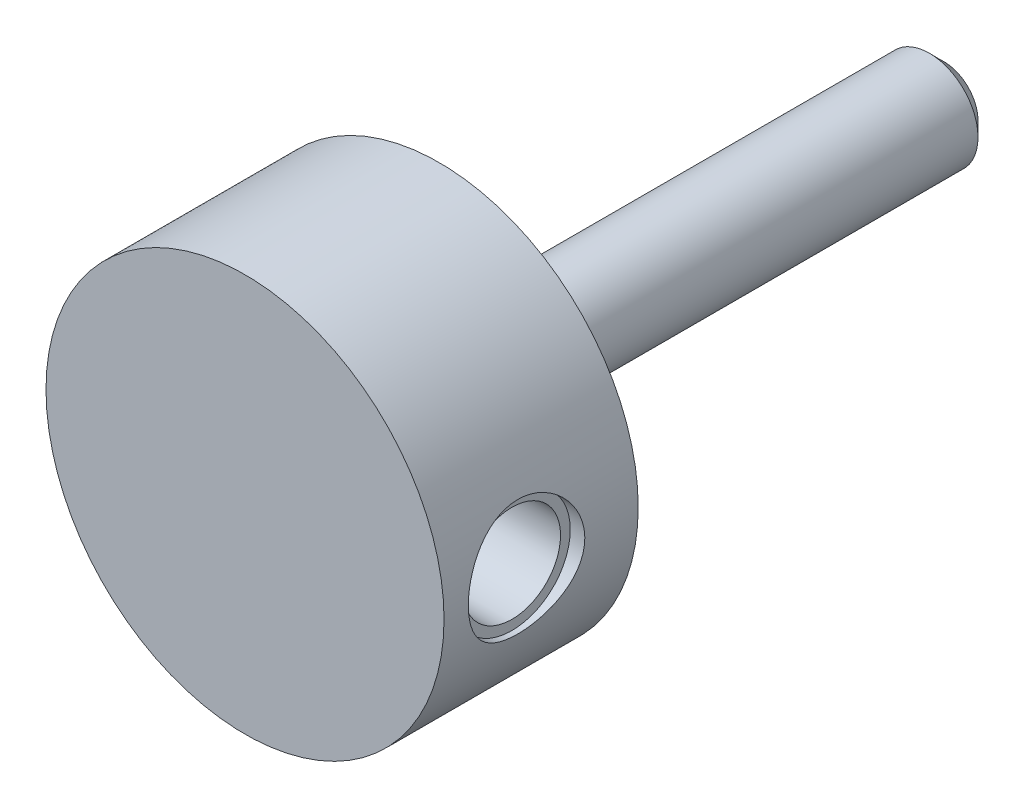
ISO-10303-21;
HEADER;
FILE_DESCRIPTION(('STEP AP214'),'2;1');
FILE_NAME('part.step','',(''),(''),'','','');
FILE_SCHEMA(('AUTOMOTIVE_DESIGN { 1 0 10303 214 1 1 1 1 }'));
ENDSEC;
DATA;
#1=APPLICATION_CONTEXT('core data for automotive mechanical design processes');
#2=APPLICATION_PROTOCOL_DEFINITION('international standard','automotive_design',2000,#1);
#3=PRODUCT_CONTEXT('',#1,'mechanical');
#4=PRODUCT('Part','Part','',(#3));
#5=PRODUCT_RELATED_PRODUCT_CATEGORY('part','',(#4));
#6=PRODUCT_DEFINITION_FORMATION('','',#4);
#7=PRODUCT_DEFINITION_CONTEXT('part definition',#1,'design');
#8=PRODUCT_DEFINITION('design','',#6,#7);
#9=PRODUCT_DEFINITION_SHAPE('','',#8);
#10=(LENGTH_UNIT() NAMED_UNIT(*) SI_UNIT(.MILLI.,.METRE.));
#11=(NAMED_UNIT(*) PLANE_ANGLE_UNIT() SI_UNIT($,.RADIAN.));
#12=(NAMED_UNIT(*) SI_UNIT($,.STERADIAN.) SOLID_ANGLE_UNIT());
#13=UNCERTAINTY_MEASURE_WITH_UNIT(LENGTH_MEASURE(1.E-05),#10,'distance_accuracy_value','');
#14=(GEOMETRIC_REPRESENTATION_CONTEXT(3) GLOBAL_UNCERTAINTY_ASSIGNED_CONTEXT((#13)) GLOBAL_UNIT_ASSIGNED_CONTEXT((#10,
#11,#12)) REPRESENTATION_CONTEXT('',''));
#15=CARTESIAN_POINT('',(0.,0.,0.));
#16=DIRECTION('',(0.,0.,1.));
#17=DIRECTION('',(1.,0.,0.));
#18=AXIS2_PLACEMENT_3D('',#15,#16,#17);
#19=CARTESIAN_POINT('',(0.,0.,0.));
#20=DIRECTION('',(0.,0.,1.));
#21=DIRECTION('',(1.,0.,0.));
#22=AXIS2_PLACEMENT_3D('',#19,#20,#21);
#23=PLANE('',#22);
#24=CARTESIAN_POINT('',(0.,0.,0.));
#25=DIRECTION('',(0.,0.,1.));
#26=DIRECTION('',(1.,0.,0.));
#27=AXIS2_PLACEMENT_3D('',#24,#25,#26);
#28=CIRCLE('',#27,9.5);
#29=CARTESIAN_POINT('',(9.5,0.,0.));
#30=VERTEX_POINT('',#29);
#31=EDGE_CURVE('E27',#30,#30,#28,.T.);
#32=ORIENTED_EDGE('',*,*,#31,.F.);
#33=EDGE_LOOP('',(#32));
#34=FACE_BOUND('',#33,.T.);
#35=CARTESIAN_POINT('',(0.,0.,0.));
#36=DIRECTION('',(0.,0.,1.));
#37=DIRECTION('',(1.,0.,0.));
#38=AXIS2_PLACEMENT_3D('',#35,#36,#37);
#39=CIRCLE('',#38,5.);
#40=CARTESIAN_POINT('',(5.,0.,0.));
#41=VERTEX_POINT('',#40);
#42=EDGE_CURVE('E23',#41,#41,#39,.F.);
#43=ORIENTED_EDGE('',*,*,#42,.F.);
#44=EDGE_LOOP('',(#43));
#45=FACE_BOUND('',#44,.T.);
#46=ADVANCED_FACE('F12',(#34,#45),#23,.F.);
#47=CARTESIAN_POINT('',(0.,0.,40.));
#48=DIRECTION('',(0.,0.,1.));
#49=DIRECTION('',(1.,0.,0.));
#50=AXIS2_PLACEMENT_3D('',#47,#48,#49);
#51=CYLINDRICAL_SURFACE('',#50,9.5);
#52=CARTESIAN_POINT('',(0.,0.,2.));
#53=DIRECTION('',(0.,0.,1.));
#54=DIRECTION('',(1.,0.,0.));
#55=AXIS2_PLACEMENT_3D('',#52,#53,#54);
#56=CIRCLE('',#55,9.5);
#57=CARTESIAN_POINT('',(9.5,0.,2.));
#58=VERTEX_POINT('',#57);
#59=EDGE_CURVE('E38',#58,#58,#56,.T.);
#60=ORIENTED_EDGE('',*,*,#59,.F.);
#61=EDGE_LOOP('',(#60));
#62=FACE_BOUND('',#61,.T.);
#63=ORIENTED_EDGE('',*,*,#31,.T.);
#64=EDGE_LOOP('',(#63));
#65=FACE_BOUND('',#64,.T.);
#66=ADVANCED_FACE('F65',(#62,#65),#51,.T.);
#67=CARTESIAN_POINT('',(20.5,0.,22.));
#68=DIRECTION('',(0.,0.,-1.));
#69=DIRECTION('',(-1.,0.,0.));
#70=AXIS2_PLACEMENT_3D('',#67,#68,#69);
#71=PLANE('',#70);
#72=CARTESIAN_POINT('',(0.,0.,22.));
#73=DIRECTION('',(0.,0.,1.));
#74=DIRECTION('',(1.,0.,0.));
#75=AXIS2_PLACEMENT_3D('',#72,#73,#74);
#76=CIRCLE('',#75,20.5);
#77=CARTESIAN_POINT('',(20.5,0.,22.));
#78=VERTEX_POINT('',#77);
#79=EDGE_CURVE('E82',#78,#78,#76,.T.);
#80=ORIENTED_EDGE('',*,*,#79,.T.);
#81=EDGE_LOOP('',(#80));
#82=FACE_BOUND('',#81,.T.);
#83=ADVANCED_FACE('F60',(#82),#71,.F.);
#84=CARTESIAN_POINT('',(0.,0.,40.));
#85=DIRECTION('',(0.,0.,1.));
#86=DIRECTION('',(1.,0.,0.));
#87=AXIS2_PLACEMENT_3D('',#84,#85,#86);
#88=CYLINDRICAL_SURFACE('',#87,20.5);
#89=CARTESIAN_POINT('',(20.5,0.,7.5));
#90=CARTESIAN_POINT('',(20.4999997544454,-0.164768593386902,7.50000038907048));
#91=CARTESIAN_POINT('',(20.4980087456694,-0.329544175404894,7.50679278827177));
#92=CARTESIAN_POINT('',(20.4900990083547,-0.65788822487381,7.5339021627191));
#93=CARTESIAN_POINT('',(20.4841800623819,-0.821456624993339,7.55421988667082));
#94=CARTESIAN_POINT('',(20.4685766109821,-1.1462122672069,7.60820100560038));
#95=CARTESIAN_POINT('',(20.4588916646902,-1.30739922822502,7.64186596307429));
#96=CARTESIAN_POINT('',(20.4360164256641,-1.62628314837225,7.72226244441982));
#97=CARTESIAN_POINT('',(20.4228249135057,-1.7839788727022,7.76899851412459));
#98=CARTESIAN_POINT('',(20.3933182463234,-2.09448185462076,7.87505403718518));
#99=CARTESIAN_POINT('',(20.3770082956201,-2.24729676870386,7.93435254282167));
#100=CARTESIAN_POINT('',(20.3416823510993,-2.54730770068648,8.06511256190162));
#101=CARTESIAN_POINT('',(20.3226662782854,-2.69450355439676,8.13657443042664));
#102=CARTESIAN_POINT('',(20.2824208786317,-2.98237032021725,8.2911456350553));
#103=CARTESIAN_POINT('',(20.2611910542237,-3.123039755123,8.37425759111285));
#104=CARTESIAN_POINT('',(20.2170775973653,-3.39691169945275,8.55150630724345));
#105=CARTESIAN_POINT('',(20.1941944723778,-3.53011647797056,8.6456396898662));
#106=CARTESIAN_POINT('',(20.146767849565,-3.79154794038,8.84682399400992));
#107=CARTESIAN_POINT('',(20.1221971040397,-3.91956600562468,8.95413966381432));
#108=CARTESIAN_POINT('',(20.0725990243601,-4.1661228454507,9.17897611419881));
#109=CARTESIAN_POINT('',(20.0475718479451,-4.2846648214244,9.29649342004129));
#110=CARTESIAN_POINT('',(19.9977175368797,-4.5116297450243,9.54108035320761));
#111=CARTESIAN_POINT('',(19.9728905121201,-4.62004743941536,9.66815487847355));
#112=CARTESIAN_POINT('',(19.9241410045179,-4.82595045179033,9.93095842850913));
#113=CARTESIAN_POINT('',(19.9002181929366,-4.92343976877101,10.0666842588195));
#114=CARTESIAN_POINT('',(19.8534354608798,-5.10885934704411,10.3490171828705));
#115=CARTESIAN_POINT('',(19.8306098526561,-5.19653638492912,10.4957964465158));
#116=CARTESIAN_POINT('',(19.7872868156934,-5.35913808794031,10.7965125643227));
#117=CARTESIAN_POINT('',(19.766788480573,-5.43406772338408,10.9504465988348));
#118=CARTESIAN_POINT('',(19.7287391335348,-5.57062666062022,11.2645036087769));
#119=CARTESIAN_POINT('',(19.7111887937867,-5.63225293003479,11.4246279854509));
#120=CARTESIAN_POINT('',(19.6796082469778,-5.74162541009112,11.7498143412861));
#121=CARTESIAN_POINT('',(19.6655765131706,-5.78937764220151,11.9148741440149));
#122=CARTESIAN_POINT('',(19.6418018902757,-5.86952471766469,12.2443484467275));
#123=CARTESIAN_POINT('',(19.6319555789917,-5.90229162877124,12.4086649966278));
#124=CARTESIAN_POINT('',(19.6163432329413,-5.95397424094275,12.7395899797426));
#125=CARTESIAN_POINT('',(19.6105755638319,-5.97289549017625,12.9061974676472));
#126=CARTESIAN_POINT('',(19.603301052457,-5.99672775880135,13.2405034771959));
#127=CARTESIAN_POINT('',(19.6017941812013,-6.00163887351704,13.4082019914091));
#128=CARTESIAN_POINT('',(19.6030905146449,-5.99740342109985,13.7434027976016));
#129=CARTESIAN_POINT('',(19.6058936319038,-5.98825713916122,13.9109050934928));
#130=CARTESIAN_POINT('',(19.6155486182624,-5.95655212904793,14.238688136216));
#131=CARTESIAN_POINT('',(19.6222578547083,-5.9344657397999,14.3990190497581));
#132=CARTESIAN_POINT('',(19.6394095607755,-5.87745500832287,14.7172343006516));
#133=CARTESIAN_POINT('',(19.649853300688,-5.84252629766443,14.8751177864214));
#134=CARTESIAN_POINT('',(19.6741615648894,-5.7601395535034,15.187257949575));
#135=CARTESIAN_POINT('',(19.688025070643,-5.71268525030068,15.3415156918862));
#136=CARTESIAN_POINT('',(19.7187796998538,-5.60560692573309,15.6454959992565));
#137=CARTESIAN_POINT('',(19.7356719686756,-5.5459782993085,15.7952168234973));
#138=CARTESIAN_POINT('',(19.7722410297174,-5.41416819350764,16.0910079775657));
#139=CARTESIAN_POINT('',(19.7919506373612,-5.34183608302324,16.2370072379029));
#140=CARTESIAN_POINT('',(19.8334359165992,-5.18568691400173,16.5224423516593));
#141=CARTESIAN_POINT('',(19.8552123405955,-5.10186566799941,16.6618757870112));
#142=CARTESIAN_POINT('',(19.9227548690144,-4.8340177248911,17.0689782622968));
#143=CARTESIAN_POINT('',(19.9707648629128,-4.63350124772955,17.3256854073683));
#144=CARTESIAN_POINT('',(20.0696162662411,-4.18511260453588,17.8126329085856));
#145=CARTESIAN_POINT('',(20.1204944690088,-3.93567819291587,18.0414205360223));
#146=CARTESIAN_POINT('',(20.2176813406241,-3.40132203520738,18.4542852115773));
#147=CARTESIAN_POINT('',(20.2639897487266,-3.11639826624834,18.63835970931));
#148=CARTESIAN_POINT('',(20.3472018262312,-2.51664006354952,18.9573414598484));
#149=CARTESIAN_POINT('',(20.3840462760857,-2.2016334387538,19.0919412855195));
#150=CARTESIAN_POINT('',(20.4437541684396,-1.55212614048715,19.3058343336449));
#151=CARTESIAN_POINT('',(20.4666213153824,-1.21763065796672,19.3851422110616));
#152=CARTESIAN_POINT('',(20.4952175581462,-0.550953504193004,19.4838192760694));
#153=CARTESIAN_POINT('',(20.5015074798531,-0.219085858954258,19.5051506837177));
#154=CARTESIAN_POINT('',(20.4978783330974,0.44350281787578,19.4927506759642));
#155=CARTESIAN_POINT('',(20.4879613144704,0.774223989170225,19.4590262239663));
#156=CARTESIAN_POINT('',(20.4533992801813,1.41781519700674,19.3390673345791));
#157=CARTESIAN_POINT('',(20.4290727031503,1.73091547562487,19.253967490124));
#158=CARTESIAN_POINT('',(20.3684901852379,2.33834273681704,19.0350155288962));
#159=CARTESIAN_POINT('',(20.3322328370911,2.63266749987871,18.901157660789));
#160=CARTESIAN_POINT('',(20.2505580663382,3.201467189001,18.585163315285));
#161=CARTESIAN_POINT('',(20.2049537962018,3.47535043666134,18.4020133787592));
#162=CARTESIAN_POINT('',(20.1098009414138,3.98926947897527,17.9937010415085));
#163=CARTESIAN_POINT('',(20.0602514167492,4.22929716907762,17.7685286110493));
#164=CARTESIAN_POINT('',(19.9860369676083,4.56311282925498,17.3996018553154));
#165=CARTESIAN_POINT('',(19.9608943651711,4.67160496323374,17.2689475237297));
#166=CARTESIAN_POINT('',(19.9116554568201,4.87720494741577,16.9988051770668));
#167=CARTESIAN_POINT('',(19.8875587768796,4.97431688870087,16.8593203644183));
#168=CARTESIAN_POINT('',(19.8411019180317,5.15650338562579,16.5723575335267));
#169=CARTESIAN_POINT('',(19.8187424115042,5.24157329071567,16.4248764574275));
#170=CARTESIAN_POINT('',(19.7764458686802,5.39896546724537,16.1230001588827));
#171=CARTESIAN_POINT('',(19.7565078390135,5.47129297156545,15.9686078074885));
#172=CARTESIAN_POINT('',(19.7197444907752,5.60234699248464,15.6546484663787));
#173=CARTESIAN_POINT('',(19.7029051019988,5.6611353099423,15.49510893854));
#174=CARTESIAN_POINT('',(19.6727610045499,5.76501533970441,15.1713718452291));
#175=CARTESIAN_POINT('',(19.6594548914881,5.81011249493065,15.0071761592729));
#176=CARTESIAN_POINT('',(19.6367999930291,5.88622676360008,14.675294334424));
#177=CARTESIAN_POINT('',(19.6274509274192,5.91724487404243,14.5076084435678));
#178=CARTESIAN_POINT('',(19.6130187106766,5.96490739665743,14.1700260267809));
#179=CARTESIAN_POINT('',(19.6079354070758,5.98155232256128,14.0001295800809));
#180=CARTESIAN_POINT('',(19.6023186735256,5.9999323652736,13.6662567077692));
#181=CARTESIAN_POINT('',(19.6016119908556,6.00223524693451,13.5023141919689));
#182=CARTESIAN_POINT('',(19.6043094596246,5.99341910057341,13.1747666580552));
#183=CARTESIAN_POINT('',(19.6077150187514,5.98229547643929,13.0111617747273));
#184=CARTESIAN_POINT('',(19.6185313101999,5.94672790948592,12.6856110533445));
#185=CARTESIAN_POINT('',(19.6259403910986,5.92228945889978,12.5236645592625));
#186=CARTESIAN_POINT('',(19.6445384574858,5.86030325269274,12.2024601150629));
#187=CARTESIAN_POINT('',(19.6557288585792,5.82275058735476,12.0432031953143));
#188=CARTESIAN_POINT('',(19.6814005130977,5.73537439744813,11.7303823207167));
#189=CARTESIAN_POINT('',(19.6958418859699,5.68569901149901,11.5767736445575));
#190=CARTESIAN_POINT('',(19.7276768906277,5.57423736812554,11.2742707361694));
#191=CARTESIAN_POINT('',(19.7450715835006,5.51244675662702,11.125378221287));
#192=CARTESIAN_POINT('',(19.782319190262,5.37724463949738,10.8333301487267));
#193=CARTESIAN_POINT('',(19.802171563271,5.30383568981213,10.6901733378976));
#194=CARTESIAN_POINT('',(19.8438063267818,5.14587421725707,10.4103722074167));
#195=CARTESIAN_POINT('',(19.8655894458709,5.061317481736,10.2737303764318));
#196=CARTESIAN_POINT('',(19.9112797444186,4.87853600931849,10.0032239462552));
#197=CARTESIAN_POINT('',(19.9352342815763,4.77994030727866,9.86961789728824));
#198=CARTESIAN_POINT('',(19.9839347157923,4.57206196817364,9.61107007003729));
#199=CARTESIAN_POINT('',(20.0086809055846,4.46277534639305,9.48613155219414));
#200=CARTESIAN_POINT('',(20.0582834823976,4.23425660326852,9.24575891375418));
#201=CARTESIAN_POINT('',(20.0831398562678,4.11502564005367,9.13032368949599));
#202=CARTESIAN_POINT('',(20.1323098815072,3.86730499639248,8.90963180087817));
#203=CARTESIAN_POINT('',(20.1566233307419,3.7388119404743,8.80437888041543));
#204=CARTESIAN_POINT('',(20.2046974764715,3.46977987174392,8.6020699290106));
#205=CARTESIAN_POINT('',(20.2284250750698,3.32900807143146,8.50531528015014));
#206=CARTESIAN_POINT('',(20.2739466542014,3.03949915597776,8.32403500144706));
#207=CARTESIAN_POINT('',(20.2957406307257,2.8907620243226,8.23950939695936));
#208=CARTESIAN_POINT('',(20.3367679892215,2.58639447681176,8.0833769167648));
#209=CARTESIAN_POINT('',(20.356002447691,2.43076699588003,8.01176460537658));
#210=CARTESIAN_POINT('',(20.3913677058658,2.11366097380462,7.88201306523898));
#211=CARTESIAN_POINT('',(20.4074988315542,1.95218304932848,7.82387242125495));
#212=CARTESIAN_POINT('',(20.4344672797,1.64423058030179,7.72771145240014));
#213=CARTESIAN_POINT('',(20.4457076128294,1.49828162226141,7.68811373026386));
#214=CARTESIAN_POINT('',(20.4651675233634,1.2036242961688,7.62002138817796));
#215=CARTESIAN_POINT('',(20.4733873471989,1.0549161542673,7.59152586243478));
#216=CARTESIAN_POINT('',(20.4866168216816,0.755624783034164,7.54584620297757));
#217=CARTESIAN_POINT('',(20.491626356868,0.605041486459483,7.52866247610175));
#218=CARTESIAN_POINT('',(20.49831762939,0.302973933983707,7.50574067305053));
#219=CARTESIAN_POINT('',(20.5000002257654,0.151489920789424,7.49999964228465));
#220=CARTESIAN_POINT('',(20.5,0.,7.5));
#221=B_SPLINE_CURVE_WITH_KNOTS('',3,(#89,#90,#91,#92,#93,#94,#95,#96,#97,#98,#99,#100,#101,#102,
#103,#104,#105,#106,#107,#108,#109,#110,#111,#112,#113,#114,#115,#116,#117,#118,#119,#120,#121,
#122,#123,#124,#125,#126,#127,#128,#129,#130,#131,#132,#133,#134,#135,#136,#137,#138,#139,#140,
#141,#142,#143,#144,#145,#146,#147,#148,#149,#150,#151,#152,#153,#154,#155,#156,#157,#158,#159,
#160,#161,#162,#163,#164,#165,#166,#167,#168,#169,#170,#171,#172,#173,#174,#175,#176,#177,#178,
#179,#180,#181,#182,#183,#184,#185,#186,#187,#188,#189,#190,#191,#192,#193,#194,#195,#196,#197,
#198,#199,#200,#201,#202,#203,#204,#205,#206,#207,#208,#209,#210,#211,#212,#213,#214,#215,#216,
#217,#218,#219,#220),.UNSPECIFIED.,.T.,.F.,(4,2,2,2,2,2,2,2,2,2,2,2,2,2,2,2,2,2,2,2,2,2,2,2,2,2,
2,2,2,2,2,2,2,2,2,2,2,2,2,2,2,2,2,2,2,2,2,2,2,2,2,2,2,2,2,2,2,2,2,2,2,2,2,2,2,4),(0.,
0.494166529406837,0.988360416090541,1.48261217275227,1.97703603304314,2.47064184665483,
2.96426207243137,3.45799348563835,3.95157399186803,4.45753270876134,4.96331976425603,
5.46936781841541,5.97523008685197,6.49206535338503,7.00869863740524,7.52544955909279,
8.04197586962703,8.54486934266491,9.04756118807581,9.55024961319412,10.0529278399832,
10.5383093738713,11.0238561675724,11.5092585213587,11.9948448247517,12.4866344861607,
12.9786038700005,13.9617709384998,14.9839152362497,16.006117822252,17.0345689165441,
18.062747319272,19.0556662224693,20.0484595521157,21.0200911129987,21.9918373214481,
22.9853318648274,23.97906383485,24.4935931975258,25.0079370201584,25.5224789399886,
26.0368090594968,26.5487427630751,27.0604726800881,27.5721663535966,28.0838417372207,
28.5751252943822,29.066577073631,29.5578262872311,30.0492596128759,30.5349645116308,
31.0208442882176,31.5066173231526,31.9925744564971,32.4953010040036,32.9982156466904,
33.5010718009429,34.0041121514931,34.5208552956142,35.0375995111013,35.5541256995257,
36.0705976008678,36.525077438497,36.9795201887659,37.4339792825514,37.8883210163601),.UNSPECIFIED.);
#222=CARTESIAN_POINT('',(20.5,0.,7.5));
#223=VERTEX_POINT('',#222);
#224=EDGE_CURVE('E30',#223,#223,#221,.T.);
#225=ORIENTED_EDGE('',*,*,#224,.T.);
#226=EDGE_LOOP('',(#225));
#227=FACE_BOUND('',#226,.T.);
#228=ORIENTED_EDGE('',*,*,#79,.F.);
#229=EDGE_LOOP('',(#228));
#230=FACE_BOUND('',#229,.T.);
#231=CARTESIAN_POINT('',(0.,0.,2.));
#232=DIRECTION('',(0.,0.,1.));
#233=DIRECTION('',(1.,0.,0.));
#234=AXIS2_PLACEMENT_3D('',#231,#232,#233);
#235=CIRCLE('',#234,20.5);
#236=CARTESIAN_POINT('',(20.5,0.,2.));
#237=VERTEX_POINT('',#236);
#238=EDGE_CURVE('E84',#237,#237,#235,.T.);
#239=ORIENTED_EDGE('',*,*,#238,.T.);
#240=EDGE_LOOP('',(#239));
#241=FACE_BOUND('',#240,.T.);
#242=ADVANCED_FACE('F41',(#227,#230,#241),#88,.T.);
#243=CARTESIAN_POINT('',(9.5,0.,2.));
#244=DIRECTION('',(0.,0.,1.));
#245=DIRECTION('',(1.,0.,0.));
#246=AXIS2_PLACEMENT_3D('',#243,#244,#245);
#247=PLANE('',#246);
#248=ORIENTED_EDGE('',*,*,#238,.F.);
#249=EDGE_LOOP('',(#248));
#250=FACE_BOUND('',#249,.T.);
#251=ORIENTED_EDGE('',*,*,#59,.T.);
#252=EDGE_LOOP('',(#251));
#253=FACE_BOUND('',#252,.T.);
#254=ADVANCED_FACE('F49',(#250,#253),#247,.F.);
#255=CARTESIAN_POINT('',(19.,0.,13.5));
#256=DIRECTION('',(1.,0.,0.));
#257=DIRECTION('',(0.,0.,-1.));
#258=AXIS2_PLACEMENT_3D('',#255,#256,#257);
#259=CYLINDRICAL_SURFACE('',#258,6.);
#260=CARTESIAN_POINT('',(19.,0.,13.5));
#261=DIRECTION('',(1.,0.,0.));
#262=DIRECTION('',(0.,0.,-1.));
#263=AXIS2_PLACEMENT_3D('',#260,#261,#262);
#264=CIRCLE('',#263,6.);
#265=CARTESIAN_POINT('',(19.,0.,7.5));
#266=VERTEX_POINT('',#265);
#267=EDGE_CURVE('E39',#266,#266,#264,.T.);
#268=ORIENTED_EDGE('',*,*,#267,.F.);
#269=EDGE_LOOP('',(#268));
#270=FACE_BOUND('',#269,.T.);
#271=ORIENTED_EDGE('',*,*,#224,.F.);
#272=EDGE_LOOP('',(#271));
#273=FACE_BOUND('',#272,.T.);
#274=ADVANCED_FACE('F47',(#270,#273),#259,.F.);
#275=CARTESIAN_POINT('',(19.,0.,13.5));
#276=DIRECTION('',(1.,0.,0.));
#277=DIRECTION('',(0.,0.,-1.));
#278=AXIS2_PLACEMENT_3D('',#275,#276,#277);
#279=PLANE('',#278);
#280=CARTESIAN_POINT('',(19.,0.,13.5));
#281=DIRECTION('',(1.,0.,0.));
#282=DIRECTION('',(0.,0.,-1.));
#283=AXIS2_PLACEMENT_3D('',#280,#281,#282);
#284=CIRCLE('',#283,5.);
#285=CARTESIAN_POINT('',(19.,0.,8.5));
#286=VERTEX_POINT('',#285);
#287=EDGE_CURVE('E96',#286,#286,#284,.T.);
#288=ORIENTED_EDGE('',*,*,#287,.F.);
#289=EDGE_LOOP('',(#288));
#290=FACE_BOUND('',#289,.T.);
#291=ORIENTED_EDGE('',*,*,#267,.T.);
#292=EDGE_LOOP('',(#291));
#293=FACE_BOUND('',#292,.T.);
#294=ADVANCED_FACE('F58',(#290,#293),#279,.T.);
#295=CARTESIAN_POINT('',(10.,0.,13.5));
#296=DIRECTION('',(1.,0.,0.));
#297=DIRECTION('',(0.,0.,-1.));
#298=AXIS2_PLACEMENT_3D('',#295,#296,#297);
#299=CYLINDRICAL_SURFACE('',#298,5.);
#300=CARTESIAN_POINT('',(10.,0.,13.5));
#301=DIRECTION('',(1.,0.,0.));
#302=DIRECTION('',(0.,0.,-1.));
#303=AXIS2_PLACEMENT_3D('',#300,#301,#302);
#304=CIRCLE('',#303,5.);
#305=CARTESIAN_POINT('',(10.,0.,8.5));
#306=VERTEX_POINT('',#305);
#307=EDGE_CURVE('E93',#306,#306,#304,.T.);
#308=ORIENTED_EDGE('',*,*,#307,.F.);
#309=EDGE_LOOP('',(#308));
#310=FACE_BOUND('',#309,.T.);
#311=ORIENTED_EDGE('',*,*,#287,.T.);
#312=EDGE_LOOP('',(#311));
#313=FACE_BOUND('',#312,.T.);
#314=ADVANCED_FACE('F100',(#310,#313),#299,.F.);
#315=CARTESIAN_POINT('',(10.,0.,13.5));
#316=DIRECTION('',(1.,0.,0.));
#317=DIRECTION('',(0.,0.,-1.));
#318=AXIS2_PLACEMENT_3D('',#315,#316,#317);
#319=PLANE('',#318);
#320=ORIENTED_EDGE('',*,*,#307,.T.);
#321=EDGE_LOOP('',(#320));
#322=FACE_BOUND('',#321,.T.);
#323=ADVANCED_FACE('F112',(#322),#319,.T.);
#324=CARTESIAN_POINT('',(0.,0.,-50.));
#325=DIRECTION('',(0.,0.,1.));
#326=DIRECTION('',(1.,0.,0.));
#327=AXIS2_PLACEMENT_3D('',#324,#325,#326);
#328=CYLINDRICAL_SURFACE('',#327,5.);
#329=CARTESIAN_POINT('',(0.,0.,-48.5));
#330=DIRECTION('',(0.,0.,-1.));
#331=DIRECTION('',(-1.,0.,0.));
#332=AXIS2_PLACEMENT_3D('',#329,#330,#331);
#333=CIRCLE('',#332,5.);
#334=CARTESIAN_POINT('',(-5.,0.,-48.5));
#335=VERTEX_POINT('',#334);
#336=EDGE_CURVE('E8',#335,#335,#333,.F.);
#337=ORIENTED_EDGE('',*,*,#336,.T.);
#338=EDGE_LOOP('',(#337));
#339=FACE_BOUND('',#338,.T.);
#340=ORIENTED_EDGE('',*,*,#42,.T.);
#341=EDGE_LOOP('',(#340));
#342=FACE_BOUND('',#341,.T.);
#343=ADVANCED_FACE('F118',(#339,#342),#328,.T.);
#344=CARTESIAN_POINT('',(0.,0.,-50.));
#345=DIRECTION('',(0.,0.,-1.));
#346=DIRECTION('',(-1.,0.,0.));
#347=AXIS2_PLACEMENT_3D('',#344,#345,#346);
#348=PLANE('',#347);
#349=CARTESIAN_POINT('',(0.,0.,-50.));
#350=DIRECTION('',(0.,0.,-1.));
#351=DIRECTION('',(-1.,0.,0.));
#352=AXIS2_PLACEMENT_3D('',#349,#350,#351);
#353=CIRCLE('',#352,3.5);
#354=CARTESIAN_POINT('',(-3.5,0.,-50.));
#355=VERTEX_POINT('',#354);
#356=EDGE_CURVE('E19',#355,#355,#353,.T.);
#357=ORIENTED_EDGE('',*,*,#356,.T.);
#358=EDGE_LOOP('',(#357));
#359=FACE_BOUND('',#358,.T.);
#360=ADVANCED_FACE('F122',(#359),#348,.T.);
#361=CARTESIAN_POINT('',(0.,0.,-50.));
#362=DIRECTION('',(0.,0.,1.));
#363=DIRECTION('',(1.,0.,0.));
#364=AXIS2_PLACEMENT_3D('',#361,#362,#363);
#365=CONICAL_SURFACE('',#364,3.5,0.785398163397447);
#366=ORIENTED_EDGE('',*,*,#336,.F.);
#367=EDGE_LOOP('',(#366));
#368=FACE_BOUND('',#367,.T.);
#369=ORIENTED_EDGE('',*,*,#356,.F.);
#370=EDGE_LOOP('',(#369));
#371=FACE_BOUND('',#370,.T.);
#372=ADVANCED_FACE('F14',(#368,#371),#365,.T.);
#373=CLOSED_SHELL('',(#46,#66,#83,#242,#254,#274,#294,#314,#323,#343,#360,#372));
#374=MANIFOLD_SOLID_BREP('B1',#373);
#375=ADVANCED_BREP_SHAPE_REPRESENTATION('',(#18,#374),#14);
#376=SHAPE_DEFINITION_REPRESENTATION(#9,#375);
ENDSEC;
END-ISO-10303-21;
